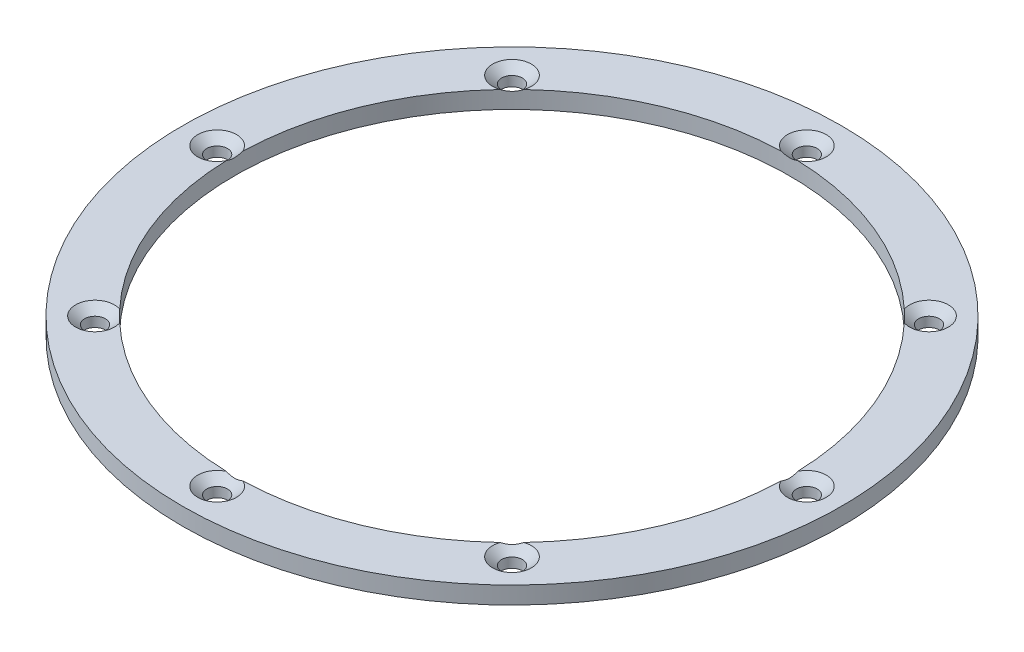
from build123d import *

# Parameters (mm, degrees)
SKETCH1_R                                         = 60.325
SKETCH1_R_2                                       = 50.8
EXTRUDE1_DEPTH                                    = 3.175
CSK_FOR_6_FLAT_HEAD_MACHINE_SCREW_100_D           = 3.7973
CSK_FOR_6_FLAT_HEAD_MACHINE_SCREW_100_CSINK_D     = 7.0866
CSK_FOR_6_FLAT_HEAD_MACHINE_SCREW_100_CSINK_ANGLE = 100
CIRPATTERN1_COUNT                                 = 8


with BuildPart() as part:
    # Sketch1 → Extrude1 (new body)
    with BuildSketch(Plane(origin=(0, 0, 0), x_dir=(1, 0, 0), z_dir=(0, 1, 0))):
        with Locations(Location((0, 0, 0), (0, 0, 270))):
            Circle(SKETCH1_R)
        with Locations(Location((0, 0, 0), (0, 0, 270))):
            Circle(SKETCH1_R_2, mode=Mode.SUBTRACT)
    extrude(amount=EXTRUDE1_DEPTH)

    # CSK for _6 Flat Head Machine Screw _100 (through all)
    with Locations(Plane(origin=(0, 3.175, 0), x_dir=(-1, 0, 0), z_dir=(0, 1, 0))):
        with Locations((-53.975, 0)):
            csk_for_6_flat_head_machine_screw_100 = CounterSinkHole(CSK_FOR_6_FLAT_HEAD_MACHINE_SCREW_100_D / 2, CSK_FOR_6_FLAT_HEAD_MACHINE_SCREW_100_CSINK_D / 2, counter_sink_angle=CSK_FOR_6_FLAT_HEAD_MACHINE_SCREW_100_CSINK_ANGLE)

    # CirPattern1: CSK for _6 Flat Head Machine Screw _100 ×8 about axis
    cirpattern1_axis = Axis((0, 0, 0), (0, 1, 0))
    for i in range(1, CIRPATTERN1_COUNT):
        add(csk_for_6_flat_head_machine_screw_100.rotate(cirpattern1_axis, i * 360 / CIRPATTERN1_COUNT), mode=Mode.SUBTRACT)


solid = part.part
